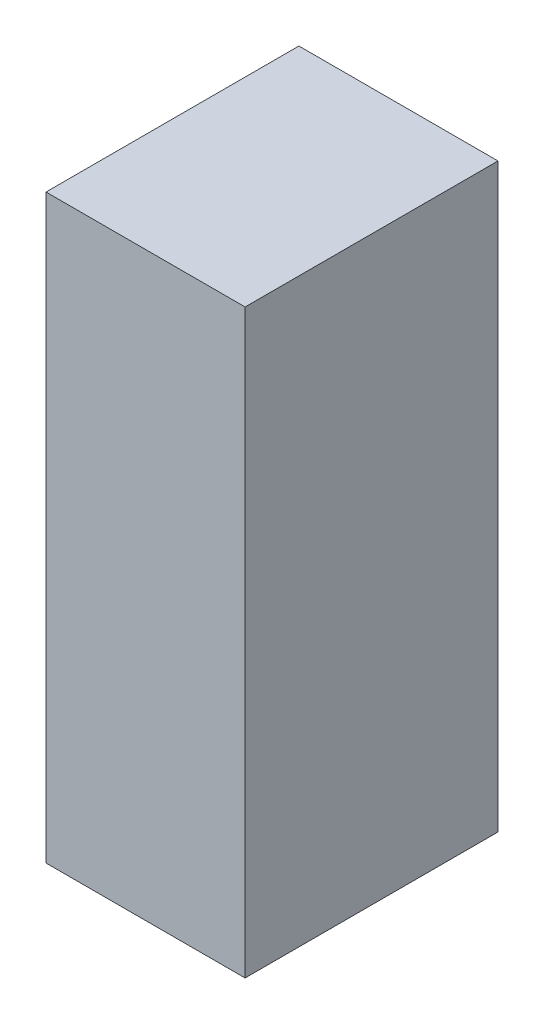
ISO-10303-21;
HEADER;
FILE_DESCRIPTION(('STEP AP214'),'2;1');
FILE_NAME('part.step','',(''),(''),'','','');
FILE_SCHEMA(('AUTOMOTIVE_DESIGN { 1 0 10303 214 1 1 1 1 }'));
ENDSEC;
DATA;
#1=APPLICATION_CONTEXT('core data for automotive mechanical design processes');
#2=APPLICATION_PROTOCOL_DEFINITION('international standard','automotive_design',2000,#1);
#3=PRODUCT_CONTEXT('',#1,'mechanical');
#4=PRODUCT('Part','Part','',(#3));
#5=PRODUCT_RELATED_PRODUCT_CATEGORY('part','',(#4));
#6=PRODUCT_DEFINITION_FORMATION('','',#4);
#7=PRODUCT_DEFINITION_CONTEXT('part definition',#1,'design');
#8=PRODUCT_DEFINITION('design','',#6,#7);
#9=PRODUCT_DEFINITION_SHAPE('','',#8);
#10=(LENGTH_UNIT() NAMED_UNIT(*) SI_UNIT(.MILLI.,.METRE.));
#11=(NAMED_UNIT(*) PLANE_ANGLE_UNIT() SI_UNIT($,.RADIAN.));
#12=(NAMED_UNIT(*) SI_UNIT($,.STERADIAN.) SOLID_ANGLE_UNIT());
#13=UNCERTAINTY_MEASURE_WITH_UNIT(LENGTH_MEASURE(1.E-05),#10,'distance_accuracy_value','');
#14=(GEOMETRIC_REPRESENTATION_CONTEXT(3) GLOBAL_UNCERTAINTY_ASSIGNED_CONTEXT((#13)) GLOBAL_UNIT_ASSIGNED_CONTEXT((#10,
#11,#12)) REPRESENTATION_CONTEXT('',''));
#15=CARTESIAN_POINT('',(0.,0.,0.));
#16=DIRECTION('',(0.,0.,1.));
#17=DIRECTION('',(1.,0.,0.));
#18=AXIS2_PLACEMENT_3D('',#15,#16,#17);
#19=CARTESIAN_POINT('',(-0.92499942,-2.69999968,0.));
#20=DIRECTION('',(-1.,0.,0.));
#21=DIRECTION('',(0.,0.,1.));
#22=AXIS2_PLACEMENT_3D('',#19,#20,#21);
#23=PLANE('',#22);
#24=DIRECTION('',(0.,0.,1.));
#25=VECTOR('',#24,1.);
#26=CARTESIAN_POINT('',(-0.92499942,2.69999968,0.));
#27=LINE('',#26,#25);
#28=CARTESIAN_POINT('',(-0.92499942,2.69999968,0.));
#29=VERTEX_POINT('',#28);
#30=CARTESIAN_POINT('',(-0.92499942,2.69999968,2.35000038));
#31=VERTEX_POINT('',#30);
#32=EDGE_CURVE('E19',#29,#31,#27,.T.);
#33=ORIENTED_EDGE('',*,*,#32,.F.);
#34=DIRECTION('',(0.,1.,0.));
#35=VECTOR('',#34,1.);
#36=CARTESIAN_POINT('',(-0.92499942,2.69999968,0.));
#37=LINE('',#36,#35);
#38=CARTESIAN_POINT('',(-0.92499942,-2.69999968,0.));
#39=VERTEX_POINT('',#38);
#40=EDGE_CURVE('E79',#29,#39,#37,.F.);
#41=ORIENTED_EDGE('',*,*,#40,.T.);
#42=DIRECTION('',(0.,0.,-1.));
#43=VECTOR('',#42,1.);
#44=CARTESIAN_POINT('',(-0.92499942,-2.69999968,0.));
#45=LINE('',#44,#43);
#46=CARTESIAN_POINT('',(-0.92499942,-2.69999968,2.35000038));
#47=VERTEX_POINT('',#46);
#48=EDGE_CURVE('E67',#47,#39,#45,.T.);
#49=ORIENTED_EDGE('',*,*,#48,.F.);
#50=DIRECTION('',(0.,1.,0.));
#51=VECTOR('',#50,1.);
#52=CARTESIAN_POINT('',(-0.92499942,2.69999968,2.35000038));
#53=LINE('',#52,#51);
#54=EDGE_CURVE('E55',#31,#47,#53,.F.);
#55=ORIENTED_EDGE('',*,*,#54,.F.);
#56=EDGE_LOOP('',(#33,#41,#49,#55));
#57=FACE_BOUND('',#56,.T.);
#58=ADVANCED_FACE('F16',(#57),#23,.T.);
#59=CARTESIAN_POINT('',(-0.92499942,2.69999968,0.));
#60=DIRECTION('',(0.,1.,0.));
#61=DIRECTION('',(0.,0.,1.));
#62=AXIS2_PLACEMENT_3D('',#59,#60,#61);
#63=PLANE('',#62);
#64=DIRECTION('',(0.,0.,-1.));
#65=VECTOR('',#64,1.);
#66=CARTESIAN_POINT('',(0.92500196,2.69999968,0.));
#67=LINE('',#66,#65);
#68=CARTESIAN_POINT('',(0.92500196,2.69999968,0.));
#69=VERTEX_POINT('',#68);
#70=CARTESIAN_POINT('',(0.92500196,2.69999968,2.35000038));
#71=VERTEX_POINT('',#70);
#72=EDGE_CURVE('E82',#69,#71,#67,.F.);
#73=ORIENTED_EDGE('',*,*,#72,.F.);
#74=DIRECTION('',(1.,0.,0.));
#75=VECTOR('',#74,1.);
#76=CARTESIAN_POINT('',(0.92500196,2.69999968,0.));
#77=LINE('',#76,#75);
#78=EDGE_CURVE('E64',#69,#29,#77,.F.);
#79=ORIENTED_EDGE('',*,*,#78,.T.);
#80=ORIENTED_EDGE('',*,*,#32,.T.);
#81=DIRECTION('',(1.,0.,0.));
#82=VECTOR('',#81,1.);
#83=CARTESIAN_POINT('',(0.92500196,2.69999968,2.35000038));
#84=LINE('',#83,#82);
#85=EDGE_CURVE('E61',#71,#31,#84,.F.);
#86=ORIENTED_EDGE('',*,*,#85,.F.);
#87=EDGE_LOOP('',(#73,#79,#80,#86));
#88=FACE_BOUND('',#87,.T.);
#89=ADVANCED_FACE('F60',(#88),#63,.T.);
#90=CARTESIAN_POINT('',(0.92500196,2.69999968,2.35000038));
#91=DIRECTION('',(0.,0.,1.));
#92=DIRECTION('',(1.,0.,0.));
#93=AXIS2_PLACEMENT_3D('',#90,#91,#92);
#94=PLANE('',#93);
#95=DIRECTION('',(1.,0.,0.));
#96=VECTOR('',#95,1.);
#97=CARTESIAN_POINT('',(0.92500196,-2.69999968,2.35000038));
#98=LINE('',#97,#96);
#99=CARTESIAN_POINT('',(0.92500196,-2.69999968,2.35000038));
#100=VERTEX_POINT('',#99);
#101=EDGE_CURVE('E69',#100,#47,#98,.F.);
#102=ORIENTED_EDGE('',*,*,#101,.F.);
#103=DIRECTION('',(0.,1.,0.));
#104=VECTOR('',#103,1.);
#105=CARTESIAN_POINT('',(0.92500196,2.69999968,2.35000038));
#106=LINE('',#105,#104);
#107=EDGE_CURVE('E73',#71,#100,#106,.F.);
#108=ORIENTED_EDGE('',*,*,#107,.F.);
#109=ORIENTED_EDGE('',*,*,#85,.T.);
#110=ORIENTED_EDGE('',*,*,#54,.T.);
#111=EDGE_LOOP('',(#102,#108,#109,#110));
#112=FACE_BOUND('',#111,.T.);
#113=ADVANCED_FACE('F71',(#112),#94,.T.);
#114=CARTESIAN_POINT('',(0.92500196,-2.69999968,0.));
#115=DIRECTION('',(0.,-1.,0.));
#116=DIRECTION('',(0.,0.,-1.));
#117=AXIS2_PLACEMENT_3D('',#114,#115,#116);
#118=PLANE('',#117);
#119=ORIENTED_EDGE('',*,*,#48,.T.);
#120=DIRECTION('',(1.,0.,0.));
#121=VECTOR('',#120,1.);
#122=CARTESIAN_POINT('',(0.92500196,-2.69999968,0.));
#123=LINE('',#122,#121);
#124=CARTESIAN_POINT('',(0.92500196,-2.69999968,0.));
#125=VERTEX_POINT('',#124);
#126=EDGE_CURVE('E34',#39,#125,#123,.T.);
#127=ORIENTED_EDGE('',*,*,#126,.T.);
#128=DIRECTION('',(0.,0.,-1.));
#129=VECTOR('',#128,1.);
#130=CARTESIAN_POINT('',(0.92500196,-2.69999968,0.));
#131=LINE('',#130,#129);
#132=EDGE_CURVE('E25',#100,#125,#131,.T.);
#133=ORIENTED_EDGE('',*,*,#132,.F.);
#134=ORIENTED_EDGE('',*,*,#101,.T.);
#135=EDGE_LOOP('',(#119,#127,#133,#134));
#136=FACE_BOUND('',#135,.T.);
#137=ADVANCED_FACE('F88',(#136),#118,.T.);
#138=CARTESIAN_POINT('',(0.92500196,2.69999968,0.));
#139=DIRECTION('',(0.,0.,1.));
#140=DIRECTION('',(1.,0.,0.));
#141=AXIS2_PLACEMENT_3D('',#138,#139,#140);
#142=PLANE('',#141);
#143=ORIENTED_EDGE('',*,*,#126,.F.);
#144=ORIENTED_EDGE('',*,*,#40,.F.);
#145=ORIENTED_EDGE('',*,*,#78,.F.);
#146=DIRECTION('',(0.,1.,0.));
#147=VECTOR('',#146,1.);
#148=CARTESIAN_POINT('',(0.92500196,2.69999968,0.));
#149=LINE('',#148,#147);
#150=EDGE_CURVE('E10',#125,#69,#149,.T.);
#151=ORIENTED_EDGE('',*,*,#150,.F.);
#152=EDGE_LOOP('',(#143,#144,#145,#151));
#153=FACE_BOUND('',#152,.T.);
#154=ADVANCED_FACE('F90',(#153),#142,.F.);
#155=CARTESIAN_POINT('',(0.92500196,2.69999968,0.));
#156=DIRECTION('',(1.,0.,0.));
#157=DIRECTION('',(0.,0.,-1.));
#158=AXIS2_PLACEMENT_3D('',#155,#156,#157);
#159=PLANE('',#158);
#160=ORIENTED_EDGE('',*,*,#132,.T.);
#161=ORIENTED_EDGE('',*,*,#150,.T.);
#162=ORIENTED_EDGE('',*,*,#72,.T.);
#163=ORIENTED_EDGE('',*,*,#107,.T.);
#164=EDGE_LOOP('',(#160,#161,#162,#163));
#165=FACE_BOUND('',#164,.T.);
#166=ADVANCED_FACE('F87',(#165),#159,.T.);
#167=CLOSED_SHELL('',(#58,#89,#113,#137,#154,#166));
#168=MANIFOLD_SOLID_BREP('B1',#167);
#169=ADVANCED_BREP_SHAPE_REPRESENTATION('',(#18,#168),#14);
#170=SHAPE_DEFINITION_REPRESENTATION(#9,#169);
ENDSEC;
END-ISO-10303-21;
